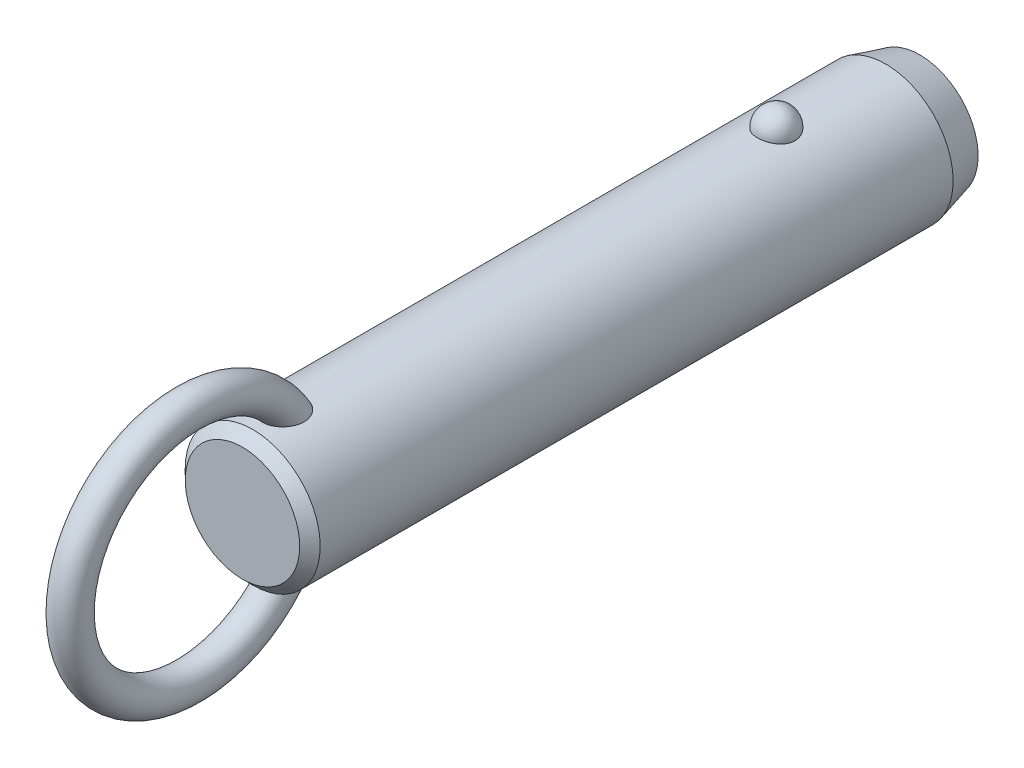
ISO-10303-21;
HEADER;
FILE_DESCRIPTION(('STEP AP214'),'2;1');
FILE_NAME('part.step','',(''),(''),'','','');
FILE_SCHEMA(('AUTOMOTIVE_DESIGN { 1 0 10303 214 1 1 1 1 }'));
ENDSEC;
DATA;
#1=APPLICATION_CONTEXT('core data for automotive mechanical design processes');
#2=APPLICATION_PROTOCOL_DEFINITION('international standard','automotive_design',2000,#1);
#3=PRODUCT_CONTEXT('',#1,'mechanical');
#4=PRODUCT('Part','Part','',(#3));
#5=PRODUCT_RELATED_PRODUCT_CATEGORY('part','',(#4));
#6=PRODUCT_DEFINITION_FORMATION('','',#4);
#7=PRODUCT_DEFINITION_CONTEXT('part definition',#1,'design');
#8=PRODUCT_DEFINITION('design','',#6,#7);
#9=PRODUCT_DEFINITION_SHAPE('','',#8);
#10=(LENGTH_UNIT() NAMED_UNIT(*) SI_UNIT(.MILLI.,.METRE.));
#11=(NAMED_UNIT(*) PLANE_ANGLE_UNIT() SI_UNIT($,.RADIAN.));
#12=(NAMED_UNIT(*) SI_UNIT($,.STERADIAN.) SOLID_ANGLE_UNIT());
#13=UNCERTAINTY_MEASURE_WITH_UNIT(LENGTH_MEASURE(1.E-05),#10,'distance_accuracy_value','');
#14=(GEOMETRIC_REPRESENTATION_CONTEXT(3) GLOBAL_UNCERTAINTY_ASSIGNED_CONTEXT((#13)) GLOBAL_UNIT_ASSIGNED_CONTEXT((#10,
#11,#12)) REPRESENTATION_CONTEXT('',''));
#15=CARTESIAN_POINT('',(0.,0.,0.));
#16=DIRECTION('',(0.,0.,1.));
#17=DIRECTION('',(1.,0.,0.));
#18=AXIS2_PLACEMENT_3D('',#15,#16,#17);
#19=CARTESIAN_POINT('',(0.,0.,50.8));
#20=DIRECTION('',(0.,0.,-1.));
#21=DIRECTION('',(-1.,0.,0.));
#22=AXIS2_PLACEMENT_3D('',#19,#20,#21);
#23=CYLINDRICAL_SURFACE('',#22,7.9);
#24=CARTESIAN_POINT('',(2.1785689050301,7.59367088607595,-2.2));
#25=CARTESIAN_POINT('',(2.17856679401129,7.59367269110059,-2.07701843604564));
#26=CARTESIAN_POINT('',(2.16853481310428,7.59657145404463,-1.95401006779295));
#27=CARTESIAN_POINT('',(2.12864689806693,7.607843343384,-1.71147811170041));
#28=CARTESIAN_POINT('',(2.09878338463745,7.61621856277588,-1.59195587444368));
#29=CARTESIAN_POINT('',(2.0199931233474,7.63749180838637,-1.35985638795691));
#30=CARTESIAN_POINT('',(1.97107475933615,7.6503878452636,-1.24727610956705));
#31=CARTESIAN_POINT('',(1.85539377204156,7.67926115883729,-1.03213234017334));
#32=CARTESIAN_POINT('',(1.78863158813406,7.69523835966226,-0.9295686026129));
#33=CARTESIAN_POINT('',(1.63856494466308,7.7285848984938,-0.736786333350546));
#34=CARTESIAN_POINT('',(1.55518140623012,7.7459606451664,-0.646630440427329));
#35=CARTESIAN_POINT('',(1.37422937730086,7.78009978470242,-0.481747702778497));
#36=CARTESIAN_POINT('',(1.27666086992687,7.79686317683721,-0.4070208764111));
#37=CARTESIAN_POINT('',(1.07024728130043,7.82786153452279,-0.275278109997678));
#38=CARTESIAN_POINT('',(0.961434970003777,7.84210353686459,-0.218212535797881));
#39=CARTESIAN_POINT('',(0.735351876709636,7.86652194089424,-0.123146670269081));
#40=CARTESIAN_POINT('',(0.618082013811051,7.87669878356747,-0.0851443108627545));
#41=CARTESIAN_POINT('',(0.380637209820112,7.89170521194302,-0.0298158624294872));
#42=CARTESIAN_POINT('',(0.260550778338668,7.89662650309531,-0.0121347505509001));
#43=CARTESIAN_POINT('',(0.0190117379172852,7.90090003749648,0.00324379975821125));
#44=CARTESIAN_POINT('',(-0.102440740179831,7.90025280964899,0.000943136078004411));
#45=CARTESIAN_POINT('',(-0.341452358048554,7.89351056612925,-0.0233955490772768));
#46=CARTESIAN_POINT('',(-0.459042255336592,7.88749257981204,-0.0451545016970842));
#47=CARTESIAN_POINT('',(-0.688796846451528,7.87075812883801,-0.107408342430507));
#48=CARTESIAN_POINT('',(-0.800961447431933,7.86004158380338,-0.147903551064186));
#49=CARTESIAN_POINT('',(-1.01743634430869,7.83497131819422,-0.246799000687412));
#50=CARTESIAN_POINT('',(-1.12169791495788,7.82059709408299,-0.305300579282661));
#51=CARTESIAN_POINT('',(-1.31891765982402,7.78976470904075,-0.438549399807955));
#52=CARTESIAN_POINT('',(-1.41187469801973,7.77330633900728,-0.513298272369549));
#53=CARTESIAN_POINT('',(-1.58577142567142,7.73972434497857,-0.678622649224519));
#54=CARTESIAN_POINT('',(-1.66645140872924,7.72259402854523,-0.769470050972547));
#55=CARTESIAN_POINT('',(-1.81161503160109,7.68983776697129,-0.963538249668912));
#56=CARTESIAN_POINT('',(-1.87609753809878,7.6742119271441,-1.06675991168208));
#57=CARTESIAN_POINT('',(-1.98790138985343,7.6460202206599,-1.28401170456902));
#58=CARTESIAN_POINT('',(-2.03501994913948,7.63349104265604,-1.39815107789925));
#59=CARTESIAN_POINT('',(-2.10986724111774,7.6131449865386,-1.63301784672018));
#60=CARTESIAN_POINT('',(-2.1375965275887,7.60532797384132,-1.75374505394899));
#61=CARTESIAN_POINT('',(-2.17289256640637,7.5953195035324,-1.99782562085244));
#62=CARTESIAN_POINT('',(-2.18054294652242,7.59310471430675,-2.12116592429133));
#63=CARTESIAN_POINT('',(-2.17572919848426,7.59448538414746,-2.36741799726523));
#64=CARTESIAN_POINT('',(-2.1632656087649,7.59808068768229,-2.49032977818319));
#65=CARTESIAN_POINT('',(-2.11865035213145,7.61064035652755,-2.73161015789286));
#66=CARTESIAN_POINT('',(-2.08659579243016,7.61957823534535,-2.84999812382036));
#67=CARTESIAN_POINT('',(-2.00367799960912,7.64179982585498,-3.07955956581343));
#68=CARTESIAN_POINT('',(-1.9528140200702,7.65508371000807,-3.19073275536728));
#69=CARTESIAN_POINT('',(-1.83321113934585,7.68460381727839,-3.40337899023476));
#70=CARTESIAN_POINT('',(-1.76437735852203,7.70085556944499,-3.50479651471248));
#71=CARTESIAN_POINT('',(-1.61069526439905,7.73445734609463,-3.69446912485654));
#72=CARTESIAN_POINT('',(-1.52584634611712,7.75180741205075,-3.78272371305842));
#73=CARTESIAN_POINT('',(-1.34198059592,7.78574608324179,-3.94393987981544));
#74=CARTESIAN_POINT('',(-1.24291308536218,7.80233167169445,-4.01684434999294));
#75=CARTESIAN_POINT('',(-1.03352039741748,7.83281625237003,-4.14489386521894));
#76=CARTESIAN_POINT('',(-0.92319600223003,7.84671543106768,-4.20004014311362));
#77=CARTESIAN_POINT('',(-0.695822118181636,7.87011575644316,-4.29042017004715));
#78=CARTESIAN_POINT('',(-0.578872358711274,7.87966903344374,-4.32589112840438));
#79=CARTESIAN_POINT('',(-0.340410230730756,7.8935652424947,-4.37692226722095));
#80=CARTESIAN_POINT('',(-0.218898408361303,7.89790879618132,-4.39248482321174));
#81=CARTESIAN_POINT('',(0.0228107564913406,7.90087453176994,-4.40314405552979));
#82=CARTESIAN_POINT('',(0.142990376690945,7.89960185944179,-4.39861683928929));
#83=CARTESIAN_POINT('',(0.380829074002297,7.89171262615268,-4.37008293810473));
#84=CARTESIAN_POINT('',(0.498488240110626,7.8850962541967,-4.34607694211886));
#85=CARTESIAN_POINT('',(0.727535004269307,7.86726442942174,-4.27939317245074));
#86=CARTESIAN_POINT('',(0.838944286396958,7.85606616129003,-4.23678512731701));
#87=CARTESIAN_POINT('',(1.05295421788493,7.83025654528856,-4.13408348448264));
#88=CARTESIAN_POINT('',(1.15555431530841,7.81564498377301,-4.07398879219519));
#89=CARTESIAN_POINT('',(1.35076763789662,7.7843022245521,-3.93687432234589));
#90=CARTESIAN_POINT('',(1.4432046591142,7.76754209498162,-3.85961036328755));
#91=CARTESIAN_POINT('',(1.6139111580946,7.73387857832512,-3.69076949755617));
#92=CARTESIAN_POINT('',(1.6921781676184,7.71697516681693,-3.59919010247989));
#93=CARTESIAN_POINT('',(1.83380875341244,7.6845643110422,-3.40247278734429));
#94=CARTESIAN_POINT('',(1.89689280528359,7.66908588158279,-3.29712873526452));
#95=CARTESIAN_POINT('',(2.0047823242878,7.64159441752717,-3.07707931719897));
#96=CARTESIAN_POINT('',(2.0495945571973,7.62958010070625,-2.96237743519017));
#97=CARTESIAN_POINT('',(2.11580183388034,7.61146617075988,-2.74040519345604));
#98=CARTESIAN_POINT('',(2.13929812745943,7.60484503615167,-2.63379846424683));
#99=CARTESIAN_POINT('',(2.17068242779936,7.59594664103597,-2.41813481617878));
#100=CARTESIAN_POINT('',(2.17857077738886,7.59366928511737,-2.30907795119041));
#101=CARTESIAN_POINT('',(2.1785689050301,7.59367088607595,-2.2));
#102=B_SPLINE_CURVE_WITH_KNOTS('',3,(#24,#25,#26,#27,#28,#29,#30,#31,#32,#33,#34,#35,#36,#37,
#38,#39,#40,#41,#42,#43,#44,#45,#46,#47,#48,#49,#50,#51,#52,#53,#54,#55,#56,#57,#58,#59,#60,#61,
#62,#63,#64,#65,#66,#67,#68,#69,#70,#71,#72,#73,#74,#75,#76,#77,#78,#79,#80,#81,#82,#83,#84,#85,
#86,#87,#88,#89,#90,#91,#92,#93,#94,#95,#96,#97,#98,#99,#100,#101),.UNSPECIFIED.,.T.,.F.,(4,2,2,
2,2,2,2,2,2,2,2,2,2,2,2,2,2,2,2,2,2,2,2,2,2,2,2,2,2,2,2,2,2,2,2,2,2,2,4),(0.,0.368552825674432,
0.737246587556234,1.10577831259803,1.4743009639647,1.8446206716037,2.21494081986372,
2.5842105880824,2.95344028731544,3.31611630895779,3.67875788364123,4.03628044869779,
4.39380913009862,4.75338791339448,5.11300280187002,5.47939989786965,5.8458226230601,
6.21639834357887,6.58696347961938,6.95598276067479,7.32499216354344,7.69218715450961,
8.0593967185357,8.42858578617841,8.79778880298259,9.16834203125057,9.5388695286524,
9.90482699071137,10.2707407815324,10.6298333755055,10.9889132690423,11.3466585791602,
11.7044262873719,12.0676511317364,12.4309391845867,12.8004764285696,13.1698767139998,
13.4967701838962,13.8236564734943),.UNSPECIFIED.);
#103=CARTESIAN_POINT('',(2.1785689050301,7.59367088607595,-2.2));
#104=VERTEX_POINT('',#103);
#105=EDGE_CURVE('E41',#104,#104,#102,.T.);
#106=ORIENTED_EDGE('',*,*,#105,.T.);
#107=EDGE_LOOP('',(#106));
#108=FACE_BOUND('',#107,.T.);
#109=CARTESIAN_POINT('',(0.,0.,59.12));
#110=DIRECTION('',(0.,0.,1.));
#111=DIRECTION('',(1.,0.,0.));
#112=AXIS2_PLACEMENT_3D('',#109,#110,#111);
#113=CIRCLE('',#112,7.9);
#114=CARTESIAN_POINT('',(7.9,0.,59.12));
#115=VERTEX_POINT('',#114);
#116=EDGE_CURVE('E10',#115,#115,#113,.F.);
#117=ORIENTED_EDGE('',*,*,#116,.T.);
#118=EDGE_LOOP('',(#117));
#119=FACE_BOUND('',#118,.T.);
#120=CARTESIAN_POINT('',(-0.630969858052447,-7.87476203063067,53.0124322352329));
#121=CARTESIAN_POINT('',(-0.734180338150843,-7.8664899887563,53.047285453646));
#122=CARTESIAN_POINT('',(-0.834476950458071,-7.85639291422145,53.0908160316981));
#123=CARTESIAN_POINT('',(-1.0262035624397,-7.83366343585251,53.194094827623));
#124=CARTESIAN_POINT('',(-1.1176141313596,-7.82102565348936,53.2538775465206));
#125=CARTESIAN_POINT('',(-1.28877277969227,-7.79464922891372,53.3878390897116));
#126=CARTESIAN_POINT('',(-1.36854014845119,-7.78091246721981,53.461993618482));
#127=CARTESIAN_POINT('',(-1.51461521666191,-7.75380398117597,53.6224941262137));
#128=CARTESIAN_POINT('',(-1.58092966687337,-7.74043207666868,53.7088339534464));
#129=CARTESIAN_POINT('',(-1.70019064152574,-7.71512522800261,53.8929784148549));
#130=CARTESIAN_POINT('',(-1.75284037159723,-7.70322473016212,53.9909792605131));
#131=CARTESIAN_POINT('',(-1.84263464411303,-7.68224112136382,54.1941029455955));
#132=CARTESIAN_POINT('',(-1.87977299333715,-7.6731591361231,54.2992286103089));
#133=CARTESIAN_POINT('',(-1.94152728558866,-7.65777930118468,54.5232849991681));
#134=CARTESIAN_POINT('',(-1.96475471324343,-7.65179654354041,54.6426167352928));
#135=CARTESIAN_POINT('',(-1.99449499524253,-7.64409642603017,54.8834298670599));
#136=CARTESIAN_POINT('',(-2.0010005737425,-7.64238092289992,55.0049121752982));
#137=CARTESIAN_POINT('',(-1.99856014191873,-7.64302120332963,55.2683409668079));
#138=CARTESIAN_POINT('',(-1.98680021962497,-7.64611845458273,55.4102565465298));
#139=CARTESIAN_POINT('',(-1.94457772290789,-7.65696186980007,55.6911188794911));
#140=CARTESIAN_POINT('',(-1.91409393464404,-7.66471330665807,55.8300620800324));
#141=CARTESIAN_POINT('',(-1.82768670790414,-7.68582947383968,56.131939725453));
#142=CARTESIAN_POINT('',(-1.76772963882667,-7.70003779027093,56.293686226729));
#143=CARTESIAN_POINT('',(-1.65998501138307,-7.72371550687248,56.5276956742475));
#144=CARTESIAN_POINT('',(-1.621079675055,-7.73200670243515,56.6042974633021));
#145=CARTESIAN_POINT('',(-1.53727726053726,-7.74910377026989,56.7540798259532));
#146=CARTESIAN_POINT('',(-1.49238215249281,-7.75790947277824,56.8272615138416));
#147=CARTESIAN_POINT('',(-1.37397050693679,-7.77993338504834,57.0028838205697));
#148=CARTESIAN_POINT('',(-1.29690364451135,-7.79328473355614,57.1029557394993));
#149=CARTESIAN_POINT('',(-1.12885487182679,-7.81939266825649,57.2907147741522));
#150=CARTESIAN_POINT('',(-1.03789926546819,-7.83215032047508,57.3784247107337));
#151=CARTESIAN_POINT('',(-0.869532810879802,-7.85231710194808,57.5134148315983));
#152=CARTESIAN_POINT('',(-0.795716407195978,-7.86021093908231,57.565076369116));
#153=CARTESIAN_POINT('',(-0.640813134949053,-7.87434920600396,57.6563815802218));
#154=CARTESIAN_POINT('',(-0.559737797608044,-7.88059619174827,57.6960438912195));
#155=CARTESIAN_POINT('',(-0.406456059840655,-7.88984116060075,57.7543008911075));
#156=CARTESIAN_POINT('',(-0.335227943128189,-7.89321892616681,57.7753848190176));
#157=CARTESIAN_POINT('',(-0.19019307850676,-7.89804235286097,57.8054141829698));
#158=CARTESIAN_POINT('',(-0.11638863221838,-7.89948969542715,57.8143701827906));
#159=CARTESIAN_POINT('',(0.0318414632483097,-7.90028409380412,57.8192915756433));
#160=CARTESIAN_POINT('',(0.106268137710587,-7.89962640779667,57.8152276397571));
#161=CARTESIAN_POINT('',(0.25329066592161,-7.8962818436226,57.7944615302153));
#162=CARTESIAN_POINT('',(0.325885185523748,-7.8935935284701,57.7777504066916));
#163=CARTESIAN_POINT('',(0.481441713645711,-7.88577340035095,57.7287380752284));
#164=CARTESIAN_POINT('',(0.563611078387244,-7.88026321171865,57.694005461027));
#165=CARTESIAN_POINT('',(0.721129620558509,-7.86741729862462,57.6117965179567));
#166=CARTESIAN_POINT('',(0.796466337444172,-7.86007832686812,57.5642975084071));
#167=CARTESIAN_POINT('',(0.971456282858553,-7.84073285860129,57.436513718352));
#168=CARTESIAN_POINT('',(1.06719686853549,-7.82809461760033,57.3510047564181));
#169=CARTESIAN_POINT('',(1.24418921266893,-7.80192439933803,57.166232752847));
#170=CARTESIAN_POINT('',(1.32540832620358,-7.78839049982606,57.0669395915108));
#171=CARTESIAN_POINT('',(1.45199971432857,-7.76559693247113,56.8895760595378));
#172=CARTESIAN_POINT('',(1.5008564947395,-7.75626094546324,56.8139542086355));
#173=CARTESIAN_POINT('',(1.59197749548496,-7.7380727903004,56.6587428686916));
#174=CARTESIAN_POINT('',(1.63423919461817,-7.72922080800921,56.5791518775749));
#175=CARTESIAN_POINT('',(1.71222612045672,-7.71231959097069,56.4166640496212));
#176=CARTESIAN_POINT('',(1.74794516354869,-7.70427111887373,56.333764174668));
#177=CARTESIAN_POINT('',(1.81270113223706,-7.68929240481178,56.1652967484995));
#178=CARTESIAN_POINT('',(1.84173789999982,-7.68236218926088,56.0797291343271));
#179=CARTESIAN_POINT('',(1.89322698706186,-7.6698375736,55.9052870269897));
#180=CARTESIAN_POINT('',(1.91558744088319,-7.66426199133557,55.8163838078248));
#181=CARTESIAN_POINT('',(1.95281367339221,-7.65485915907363,55.6369696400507));
#182=CARTESIAN_POINT('',(1.96767946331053,-7.65103190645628,55.5464586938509));
#183=CARTESIAN_POINT('',(2.00021456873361,-7.64262981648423,55.2737320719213));
#184=CARTESIAN_POINT('',(2.00600691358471,-7.6410871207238,55.0897099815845));
#185=CARTESIAN_POINT('',(1.98445334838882,-7.64669564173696,54.7765019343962));
#186=CARTESIAN_POINT('',(1.96607186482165,-7.65149688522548,54.646618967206));
#187=CARTESIAN_POINT('',(1.90884967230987,-7.6659762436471,54.3916321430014));
#188=CARTESIAN_POINT('',(1.87002101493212,-7.67565148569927,54.266525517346));
#189=CARTESIAN_POINT('',(1.77063986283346,-7.69918471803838,54.0245401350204));
#190=CARTESIAN_POINT('',(1.70993724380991,-7.71307150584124,53.9077250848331));
#191=CARTESIAN_POINT('',(1.56733070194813,-7.74330306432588,53.6881444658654));
#192=CARTESIAN_POINT('',(1.48543692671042,-7.75964665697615,53.5853722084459));
#193=CARTESIAN_POINT('',(1.31346177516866,-7.79047523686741,53.4093800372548));
#194=CARTESIAN_POINT('',(1.22547278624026,-7.80495298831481,53.3341066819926));
#195=CARTESIAN_POINT('',(1.0372435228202,-7.83218597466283,53.2004864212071));
#196=CARTESIAN_POINT('',(0.937008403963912,-7.84494192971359,53.1421324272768));
#197=CARTESIAN_POINT('',(0.733599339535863,-7.86649045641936,53.0470270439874));
#198=CARTESIAN_POINT('',(0.630941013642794,-7.87547134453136,53.0092109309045));
#199=CARTESIAN_POINT('',(0.420465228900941,-7.88950708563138,52.9511160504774));
#200=CARTESIAN_POINT('',(0.312645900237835,-7.89456050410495,52.9308436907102));
#201=CARTESIAN_POINT('',(0.0960869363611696,-7.9001518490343,52.9084559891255));
#202=CARTESIAN_POINT('',(-0.0126341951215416,-7.90073226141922,52.9061698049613));
#203=CARTESIAN_POINT('',(-0.228766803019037,-7.89742350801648,52.9193678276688));
#204=CARTESIAN_POINT('',(-0.336180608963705,-7.89354403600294,52.9348134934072));
#205=CARTESIAN_POINT('',(-0.473410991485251,-7.88586871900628,52.9662177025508));
#206=CARTESIAN_POINT('',(-0.505257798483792,-7.88388984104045,52.9743541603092));
#207=CARTESIAN_POINT('',(-0.568481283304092,-7.87958326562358,52.9922083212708));
#208=CARTESIAN_POINT('',(-0.599857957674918,-7.87725556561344,53.0019260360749));
#209=CARTESIAN_POINT('',(-0.630969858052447,-7.87476203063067,53.0124322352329));
#210=B_SPLINE_CURVE_WITH_KNOTS('',3,(#120,#121,#122,#123,#124,#125,#126,#127,#128,#129,#130,
#131,#132,#133,#134,#135,#136,#137,#138,#139,#140,#141,#142,#143,#144,#145,#146,#147,#148,#149,
#150,#151,#152,#153,#154,#155,#156,#157,#158,#159,#160,#161,#162,#163,#164,#165,#166,#167,#168,
#169,#170,#171,#172,#173,#174,#175,#176,#177,#178,#179,#180,#181,#182,#183,#184,#185,#186,#187,
#188,#189,#190,#191,#192,#193,#194,#195,#196,#197,#198,#199,#200,#201,#202,#203,#204,#205,#206,
#207,#208,#209),.UNSPECIFIED.,.T.,.F.,(4,2,2,2,2,2,2,2,2,2,2,2,2,2,2,2,2,2,2,2,2,2,2,2,2,2,2,2,
2,2,2,2,2,2,2,2,2,2,2,2,2,2,2,2,4),(0.,0.327622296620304,0.655945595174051,0.983718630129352,
1.3113267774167,1.64554655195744,1.97989964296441,2.34365728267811,2.70757317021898,
3.13333684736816,3.55958380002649,4.07655306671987,4.3352789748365,4.593919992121,
4.9738243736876,5.35301797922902,5.62348245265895,5.89352465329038,6.11565959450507,
6.3376009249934,6.56004255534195,6.782641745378,7.04930844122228,7.31645206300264,
7.70130871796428,8.08701995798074,8.35824509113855,8.62957365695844,8.90115735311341,
9.17274746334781,9.44791855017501,9.72308922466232,10.2715298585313,10.6638393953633,
11.0559179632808,11.4507403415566,11.8453740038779,12.1936425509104,12.5417649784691,
12.8695063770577,13.1973674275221,13.5221104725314,13.8461490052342,13.9449071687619,
14.0436660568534),.UNSPECIFIED.);
#211=CARTESIAN_POINT('',(-0.630969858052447,-7.87476203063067,53.0124322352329));
#212=VERTEX_POINT('',#211);
#213=EDGE_CURVE('E59',#212,#212,#210,.T.);
#214=ORIENTED_EDGE('',*,*,#213,.T.);
#215=EDGE_LOOP('',(#214));
#216=FACE_BOUND('',#215,.T.);
#217=CARTESIAN_POINT('',(-0.630969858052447,7.87476203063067,53.0124322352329));
#218=CARTESIAN_POINT('',(-0.528918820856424,7.88293636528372,52.9779798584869));
#219=CARTESIAN_POINT('',(-0.423745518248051,7.8893481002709,52.951915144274));
#220=CARTESIAN_POINT('',(-0.210236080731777,7.8979273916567,52.9172825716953));
#221=CARTESIAN_POINT('',(-0.101893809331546,7.90008607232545,52.9087513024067));
#222=CARTESIAN_POINT('',(0.114660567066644,7.89990877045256,52.9094570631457));
#223=CARTESIAN_POINT('',(0.222872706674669,7.89757640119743,52.9186798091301));
#224=CARTESIAN_POINT('',(0.436107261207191,7.88867538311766,52.9546525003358));
#225=CARTESIAN_POINT('',(0.541131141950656,7.8821087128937,52.9813942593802));
#226=CARTESIAN_POINT('',(0.745085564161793,7.86545130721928,53.0517561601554));
#227=CARTESIAN_POINT('',(0.844015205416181,7.85536005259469,53.0953787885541));
#228=CARTESIAN_POINT('',(1.03299167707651,7.83275153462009,53.1983796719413));
#229=CARTESIAN_POINT('',(1.12303841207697,7.8202342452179,53.2577580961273));
#230=CARTESIAN_POINT('',(1.29214734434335,7.79408219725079,53.3908647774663));
#231=CARTESIAN_POINT('',(1.37116907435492,7.78044359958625,53.4646436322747));
#232=CARTESIAN_POINT('',(1.51597677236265,7.75353170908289,53.6242353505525));
#233=CARTESIAN_POINT('',(1.58176261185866,7.74025841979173,53.7100483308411));
#234=CARTESIAN_POINT('',(1.70057386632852,7.71504069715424,53.893644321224));
#235=CARTESIAN_POINT('',(1.75320073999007,7.7031425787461,53.9916906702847));
#236=CARTESIAN_POINT('',(1.8429376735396,7.68216822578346,54.1948931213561));
#237=CARTESIAN_POINT('',(1.88004278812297,7.67309289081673,54.3000514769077));
#238=CARTESIAN_POINT('',(1.9417232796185,7.6577294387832,54.5241671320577));
#239=CARTESIAN_POINT('',(1.96491037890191,7.65175648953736,54.6435248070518));
#240=CARTESIAN_POINT('',(1.9945689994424,7.64407702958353,54.8843848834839));
#241=CARTESIAN_POINT('',(2.00103304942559,7.64237242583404,55.0058882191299));
#242=CARTESIAN_POINT('',(1.99850166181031,7.64303650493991,55.2693688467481));
#243=CARTESIAN_POINT('',(1.98669038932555,7.64614714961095,55.4113141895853));
#244=CARTESIAN_POINT('',(1.94436120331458,7.6570170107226,55.6922287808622));
#245=CARTESIAN_POINT('',(1.91382203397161,7.66478150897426,55.8311944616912));
#246=CARTESIAN_POINT('',(1.82728754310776,7.68592483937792,56.1331110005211));
#247=CARTESIAN_POINT('',(1.76725778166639,7.7001468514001,56.2948721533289));
#248=CARTESIAN_POINT('',(1.65939700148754,7.72384204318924,56.5288914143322));
#249=CARTESIAN_POINT('',(1.62045187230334,7.73213852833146,56.6054942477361));
#250=CARTESIAN_POINT('',(1.53656684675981,7.74924489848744,56.7552737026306));
#251=CARTESIAN_POINT('',(1.49162892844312,7.75805461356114,56.8284514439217));
#252=CARTESIAN_POINT('',(1.37317698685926,7.78007342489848,57.0039520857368));
#253=CARTESIAN_POINT('',(1.29612360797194,7.79341423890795,57.1039112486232));
#254=CARTESIAN_POINT('',(1.12812043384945,7.81949839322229,57.2914508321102));
#255=CARTESIAN_POINT('',(1.03719688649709,7.83224280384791,57.3790540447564));
#256=CARTESIAN_POINT('',(0.868871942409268,7.85239026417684,57.5138971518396));
#257=CARTESIAN_POINT('',(0.795056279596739,7.86027769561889,57.5655113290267));
#258=CARTESIAN_POINT('',(0.64016072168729,7.87440222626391,57.6567201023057));
#259=CARTESIAN_POINT('',(0.559092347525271,7.88064188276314,57.6963333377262));
#260=CARTESIAN_POINT('',(0.405820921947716,7.8898738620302,57.7545056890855));
#261=CARTESIAN_POINT('',(0.334594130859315,7.89324577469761,57.7755523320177));
#262=CARTESIAN_POINT('',(0.189568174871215,7.89805733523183,57.8055070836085));
#263=CARTESIAN_POINT('',(0.115771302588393,7.89949866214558,57.8144257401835));
#264=CARTESIAN_POINT('',(-0.0324359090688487,7.90028156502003,57.8192758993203));
#265=CARTESIAN_POINT('',(-0.106847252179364,7.89961843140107,57.8151782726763));
#266=CARTESIAN_POINT('',(-0.253834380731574,7.8962642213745,57.7943519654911));
#267=CARTESIAN_POINT('',(-0.326408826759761,7.89357170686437,57.7776143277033));
#268=CARTESIAN_POINT('',(-0.481962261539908,7.88574179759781,57.7285391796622));
#269=CARTESIAN_POINT('',(-0.564145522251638,7.88022507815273,57.6937638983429));
#270=CARTESIAN_POINT('',(-0.721685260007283,7.8673664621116,57.6114686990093));
#271=CARTESIAN_POINT('',(-0.797029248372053,7.8600213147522,57.5639260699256));
#272=CARTESIAN_POINT('',(-0.972044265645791,7.84066026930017,57.4360267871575));
#273=CARTESIAN_POINT('',(-1.06779803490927,7.82801274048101,57.3504436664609));
#274=CARTESIAN_POINT('',(-1.24480531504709,7.80182621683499,57.1655223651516));
#275=CARTESIAN_POINT('',(-1.3260261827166,7.78828530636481,57.0661540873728));
#276=CARTESIAN_POINT('',(-1.45259834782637,7.76548487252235,56.8886806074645));
#277=CARTESIAN_POINT('',(-1.50143856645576,7.75614818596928,56.8130252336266));
#278=CARTESIAN_POINT('',(-1.59252410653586,7.73796020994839,56.6577484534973));
#279=CARTESIAN_POINT('',(-1.63476690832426,7.72910910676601,56.5781255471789));
#280=CARTESIAN_POINT('',(-1.71271318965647,7.71221133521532,56.4155750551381));
#281=CARTESIAN_POINT('',(-1.7484104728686,7.70416543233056,56.3326444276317));
#282=CARTESIAN_POINT('',(-1.81311929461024,7.6891937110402,56.1641168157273));
#283=CARTESIAN_POINT('',(-1.84213067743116,7.6822679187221,56.0785197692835));
#284=CARTESIAN_POINT('',(-1.89356259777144,7.66975461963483,55.9040254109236));
#285=CARTESIAN_POINT('',(-1.91589165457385,7.66418586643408,55.8150995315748));
#286=CARTESIAN_POINT('',(-1.95305070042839,7.65479859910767,55.6356424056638));
#287=CARTESIAN_POINT('',(-1.96788069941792,7.65098008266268,55.5451111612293));
#288=CARTESIAN_POINT('',(-2.00030078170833,7.64260704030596,55.2723270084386));
#289=CARTESIAN_POINT('',(-2.00600576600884,7.64108760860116,55.0882718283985));
#290=CARTESIAN_POINT('',(-1.98428483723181,7.64673945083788,54.7750800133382));
#291=CARTESIAN_POINT('',(-1.96583698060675,7.6515575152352,54.6452400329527));
#292=CARTESIAN_POINT('',(-1.90848948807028,7.66606613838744,54.3903619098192));
#293=CARTESIAN_POINT('',(-1.86960376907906,7.67575338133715,54.265320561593));
#294=CARTESIAN_POINT('',(-1.7701342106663,7.6993013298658,54.0235009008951));
#295=CARTESIAN_POINT('',(-1.70940488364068,7.71318991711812,53.9067844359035));
#296=CARTESIAN_POINT('',(-1.56672953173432,7.74342495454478,53.6873404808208));
#297=CARTESIAN_POINT('',(-1.48478316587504,7.75977144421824,53.5846132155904));
#298=CARTESIAN_POINT('',(-1.31266325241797,7.79061163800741,53.408643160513));
#299=CARTESIAN_POINT('',(-1.22456383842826,7.80509908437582,53.3333589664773));
#300=CARTESIAN_POINT('',(-1.03622400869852,7.83231881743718,53.1998659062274));
#301=CARTESIAN_POINT('',(-0.936015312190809,7.84505551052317,53.1416137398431));
#302=CARTESIAN_POINT('',(-0.798824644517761,7.85957802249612,53.0775408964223));
#303=CARTESIAN_POINT('',(-0.765787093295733,7.86286821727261,53.0632248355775));
#304=CARTESIAN_POINT('',(-0.698939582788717,7.86909211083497,53.036436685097));
#305=CARTESIAN_POINT('',(-0.665129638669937,7.8720258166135,53.0239645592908));
#306=CARTESIAN_POINT('',(-0.630969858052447,7.87476203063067,53.0124322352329));
#307=B_SPLINE_CURVE_WITH_KNOTS('',3,(#217,#218,#219,#220,#221,#222,#223,#224,#225,#226,#227,
#228,#229,#230,#231,#232,#233,#234,#235,#236,#237,#238,#239,#240,#241,#242,#243,#244,#245,#246,
#247,#248,#249,#250,#251,#252,#253,#254,#255,#256,#257,#258,#259,#260,#261,#262,#263,#264,#265,
#266,#267,#268,#269,#270,#271,#272,#273,#274,#275,#276,#277,#278,#279,#280,#281,#282,#283,#284,
#285,#286,#287,#288,#289,#290,#291,#292,#293,#294,#295,#296,#297,#298,#299,#300,#301,#302,#303,
#304,#305,#306),.UNSPECIFIED.,.T.,.F.,(4,2,2,2,2,2,2,2,2,2,2,2,2,2,2,2,2,2,2,2,2,2,2,2,2,2,2,2,
2,2,2,2,2,2,2,2,2,2,2,2,2,2,2,2,4),(0.,0.323920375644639,0.648516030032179,0.972850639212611,
1.29703380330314,1.62126473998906,1.94549915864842,2.27089401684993,2.59629203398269,
2.93059633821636,3.26500707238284,3.6288164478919,3.99278833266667,4.41865421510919,
4.84500434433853,5.36209210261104,5.62087589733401,5.87957448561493,6.25918598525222,
6.63808782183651,6.90846748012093,7.17842501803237,7.40052350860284,7.62242871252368,
7.84483086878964,8.06739077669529,8.33414615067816,8.60137921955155,8.98641454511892,
9.3723041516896,9.64358673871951,9.91497268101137,10.1866142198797,10.4582620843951,
10.7334745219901,11.0086865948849,11.5572126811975,11.9494246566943,12.3413699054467,
12.7359755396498,13.1305875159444,13.4791770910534,13.82687259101,13.9353013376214,
14.0437279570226),.UNSPECIFIED.);
#308=CARTESIAN_POINT('',(-0.630969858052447,7.87476203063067,53.0124322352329));
#309=VERTEX_POINT('',#308);
#310=EDGE_CURVE('E67',#309,#309,#307,.T.);
#311=ORIENTED_EDGE('',*,*,#310,.T.);
#312=EDGE_LOOP('',(#311));
#313=FACE_BOUND('',#312,.T.);
#314=CARTESIAN_POINT('',(0.,0.,-14.9999999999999));
#315=DIRECTION('',(0.,0.,-1.));
#316=DIRECTION('',(-1.,0.,0.));
#317=AXIS2_PLACEMENT_3D('',#314,#315,#316);
#318=CIRCLE('',#317,7.9);
#319=CARTESIAN_POINT('',(-7.9,0.,-14.9999999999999));
#320=VERTEX_POINT('',#319);
#321=EDGE_CURVE('E56',#320,#320,#318,.F.);
#322=ORIENTED_EDGE('',*,*,#321,.T.);
#323=EDGE_LOOP('',(#322));
#324=FACE_BOUND('',#323,.T.);
#325=ADVANCED_FACE('F37',(#108,#119,#216,#313,#324),#23,.T.);
#326=CARTESIAN_POINT('',(0.,0.,-19.));
#327=DIRECTION('',(0.,0.,-1.));
#328=DIRECTION('',(-1.,0.,0.));
#329=AXIS2_PLACEMENT_3D('',#326,#327,#328);
#330=PLANE('',#329);
#331=CARTESIAN_POINT('',(0.,0.,-19.));
#332=DIRECTION('',(0.,0.,-1.));
#333=DIRECTION('',(-1.,0.,0.));
#334=AXIS2_PLACEMENT_3D('',#331,#332,#333);
#335=CIRCLE('',#334,6.82820323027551);
#336=CARTESIAN_POINT('',(-6.82820323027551,0.,-19.));
#337=VERTEX_POINT('',#336);
#338=EDGE_CURVE('E66',#337,#337,#335,.T.);
#339=ORIENTED_EDGE('',*,*,#338,.T.);
#340=EDGE_LOOP('',(#339));
#341=FACE_BOUND('',#340,.T.);
#342=ADVANCED_FACE('F85',(#341),#330,.T.);
#343=CARTESIAN_POINT('',(0.,0.,-19.));
#344=DIRECTION('',(0.,0.,1.));
#345=DIRECTION('',(1.,0.,0.));
#346=AXIS2_PLACEMENT_3D('',#343,#344,#345);
#347=CONICAL_SURFACE('',#346,6.8282032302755,0.261799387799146);
#348=ORIENTED_EDGE('',*,*,#321,.F.);
#349=EDGE_LOOP('',(#348));
#350=FACE_BOUND('',#349,.T.);
#351=ORIENTED_EDGE('',*,*,#338,.F.);
#352=EDGE_LOOP('',(#351));
#353=FACE_BOUND('',#352,.T.);
#354=ADVANCED_FACE('F83',(#350,#353),#347,.T.);
#355=CARTESIAN_POINT('',(0.,0.,60.32));
#356=DIRECTION('',(0.,0.,1.));
#357=DIRECTION('',(1.,0.,0.));
#358=AXIS2_PLACEMENT_3D('',#355,#356,#357);
#359=PLANE('',#358);
#360=CARTESIAN_POINT('',(0.,0.,60.32));
#361=DIRECTION('',(0.,0.,1.));
#362=DIRECTION('',(1.,0.,0.));
#363=AXIS2_PLACEMENT_3D('',#360,#361,#362);
#364=CIRCLE('',#363,6.70000000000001);
#365=CARTESIAN_POINT('',(6.70000000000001,0.,60.32));
#366=VERTEX_POINT('',#365);
#367=EDGE_CURVE('E50',#366,#366,#364,.T.);
#368=ORIENTED_EDGE('',*,*,#367,.T.);
#369=EDGE_LOOP('',(#368));
#370=FACE_BOUND('',#369,.T.);
#371=ADVANCED_FACE('F77',(#370),#359,.T.);
#372=CARTESIAN_POINT('',(0.,0.,66.65));
#373=DIRECTION('',(1.,0.,0.));
#374=DIRECTION('',(0.,0.,-1.));
#375=AXIS2_PLACEMENT_3D('',#372,#373,#374);
#376=TOROIDAL_SURFACE('',#375,13.85,2.);
#377=ORIENTED_EDGE('',*,*,#310,.F.);
#378=EDGE_LOOP('',(#377));
#379=FACE_BOUND('',#378,.T.);
#380=ORIENTED_EDGE('',*,*,#213,.F.);
#381=EDGE_LOOP('',(#380));
#382=FACE_BOUND('',#381,.T.);
#383=ADVANCED_FACE('F73',(#379,#382),#376,.T.);
#384=CARTESIAN_POINT('',(0.,0.,60.32));
#385=DIRECTION('',(0.,0.,-1.));
#386=DIRECTION('',(-1.,0.,0.));
#387=AXIS2_PLACEMENT_3D('',#384,#385,#386);
#388=CONICAL_SURFACE('',#387,6.70000000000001,0.78539816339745);
#389=ORIENTED_EDGE('',*,*,#116,.F.);
#390=EDGE_LOOP('',(#389));
#391=FACE_BOUND('',#390,.T.);
#392=ORIENTED_EDGE('',*,*,#367,.F.);
#393=EDGE_LOOP('',(#392));
#394=FACE_BOUND('',#393,.T.);
#395=ADVANCED_FACE('F39',(#391,#394),#388,.T.);
#396=CARTESIAN_POINT('',(0.,7.9,-2.2));
#397=DIRECTION('',(0.,1.,0.));
#398=DIRECTION('',(0.,0.,-1.));
#399=AXIS2_PLACEMENT_3D('',#396,#397,#398);
#400=SPHERICAL_SURFACE('',#399,2.2);
#401=ORIENTED_EDGE('',*,*,#105,.F.);
#402=EDGE_LOOP('',(#401));
#403=FACE_BOUND('',#402,.T.);
#404=ADVANCED_FACE('F79',(#403),#400,.T.);
#405=CLOSED_SHELL('',(#325,#342,#354,#371,#383,#395,#404));
#406=MANIFOLD_SOLID_BREP('B2',#405);
#407=ADVANCED_BREP_SHAPE_REPRESENTATION('',(#18,#406),#14);
#408=SHAPE_DEFINITION_REPRESENTATION(#9,#407);
ENDSEC;
END-ISO-10303-21;
